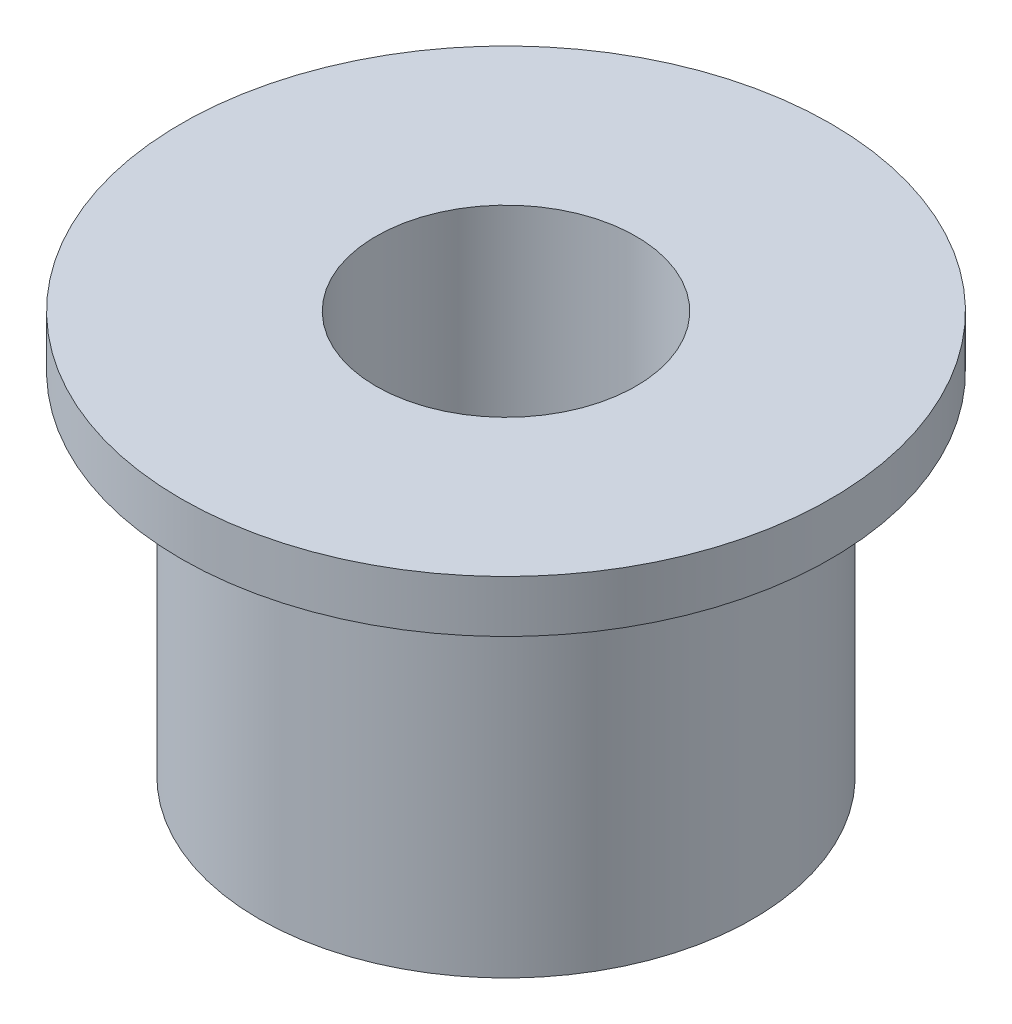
from build123d import *


with BuildPart() as part:
    # Sketch1 → Revolve1 (revolve)
    with BuildSketch(Plane.XY, mode=Mode.PRIVATE) as revolve1_sk:
        Polygon((10, 31), (25, 31), (25, 27), (19, 27), (19, 0), (10, 0), align=None)
    revolve(revolve1_sk.sketch.rotate(Axis((0, 38.1, 0), (0, -1, 0)), 90), axis=Axis((0, 38.1, 0), (0, -1, 0)))


solid = part.part
